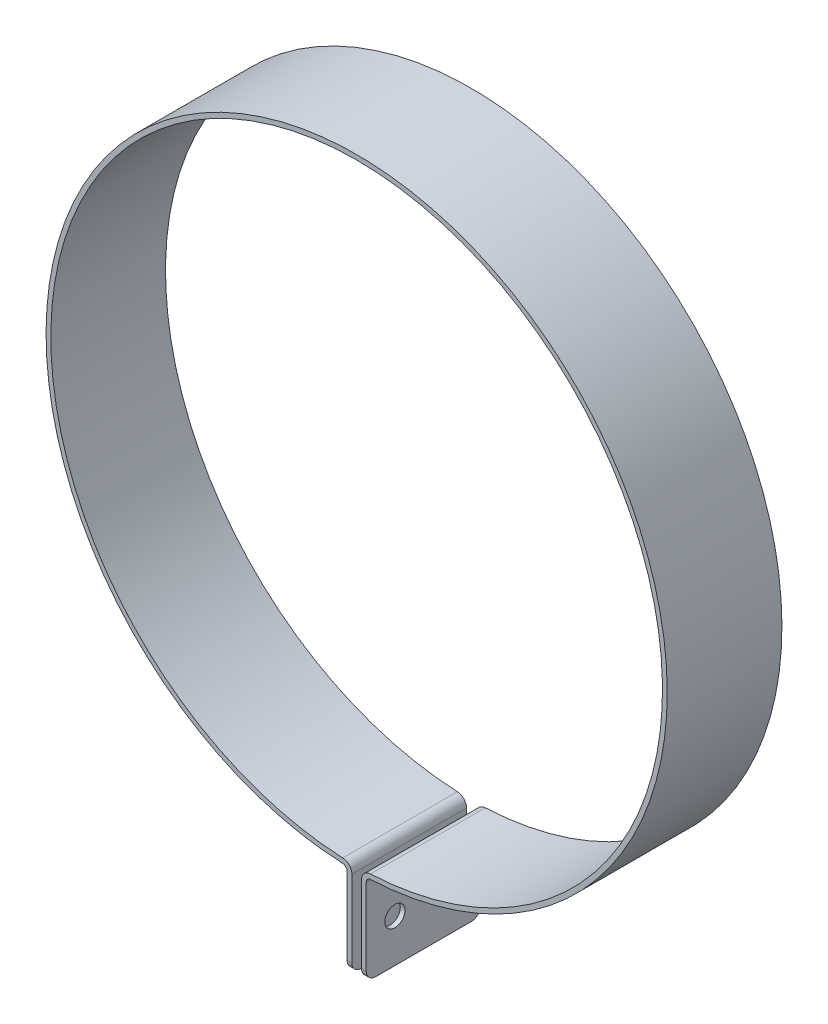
from build123d import *

# Parameters (mm, degrees)
SKETCH1_R           = 103.1748
SKETCH1_R_2         = 101.6
BOSS_EXTRUDE1_DEPTH = 38.1
SKETCH2_W           = 6.35
SKETCH2_H           = 31.75
BOSS_EXTRUDE2_DEPTH = 38.1
SKETCH3_W           = 3.2004
SKETCH3_H           = 44.45
CUT_EXTRUDE1_DEPTH  = 173.855060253
FILLET1_R           = 1.5748
FILLET2_R           = 3.175
SKETCH4_R           = 3.3655
CUT_EXTRUDE2_DEPTH  = 175.768739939


with BuildPart() as part:
    # Sketch1 → Boss-Extrude1 (new body)
    with BuildSketch(Plane.XY):
        Circle(SKETCH1_R)
        Circle(SKETCH1_R_2, mode=Mode.SUBTRACT)
    extrude(amount=-BOSS_EXTRUDE1_DEPTH)

    # Sketch2 → Boss-Extrude2 (add)
    with BuildSketch(Plane.XY):
        with Locations((0, -117.475)):
            Rectangle(SKETCH2_W, SKETCH2_H)
    extrude(amount=-BOSS_EXTRUDE2_DEPTH)

    # Sketch3 → Cut-Extrude1 (cut, through all)
    with BuildSketch(Plane.XY):
        with Locations((0, -117.475)):
            Rectangle(SKETCH3_W, SKETCH3_H)
    extrude(amount=-CUT_EXTRUDE1_DEPTH, mode=Mode.SUBTRACT)

    # Fillet1
    fillet1_edges = [part.edges().sort_by_distance(p)[0] for p in [
        (-3.175, -103.125936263, -19.05),
        (3.175, -103.125936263, -19.05),
    ]]
    fillet(fillet1_edges, radius=FILLET1_R)

    # Fillet2
    fillet2_edges = [part.edges().sort_by_distance(p)[0] for p in [
        (-2.3876, -133.35, -38.1),
        (-2.3876, -133.35, 0),
        (2.3876, -133.35, 0),
        (2.3876, -133.35, -38.1),
        (-1.6002, -101.587397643, -19.05),
        (1.6002, -101.587397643, -19.05),
    ]]
    fillet(fillet2_edges, radius=FILLET2_R)

    # Sketch4 → Cut-Extrude2 (cut, through all)
    with BuildSketch(Plane(origin=(3.175, 0, 0), x_dir=(0, 0, -1), z_dir=(1, 0, 0))):
        with Locations((9.525, -119.0752)):
            Circle(SKETCH4_R)
        with Locations((28.575, -119.0752)):
            Circle(SKETCH4_R)
    extrude(amount=-CUT_EXTRUDE2_DEPTH, mode=Mode.SUBTRACT)


solid = part.part
